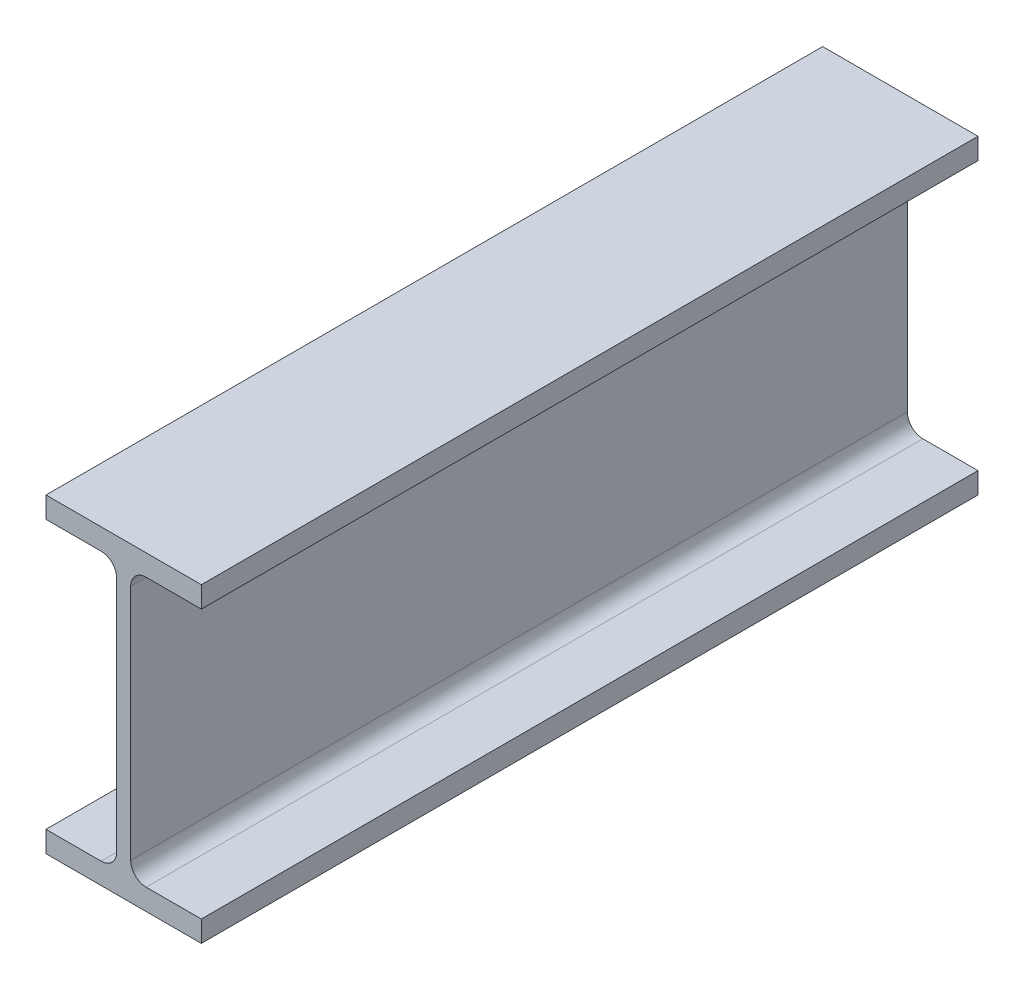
ISO-10303-21;
HEADER;
FILE_DESCRIPTION(('STEP AP214'),'2;1');
FILE_NAME('part.step','',(''),(''),'','','');
FILE_SCHEMA(('AUTOMOTIVE_DESIGN { 1 0 10303 214 1 1 1 1 }'));
ENDSEC;
DATA;
#1=APPLICATION_CONTEXT('core data for automotive mechanical design processes');
#2=APPLICATION_PROTOCOL_DEFINITION('international standard','automotive_design',2000,#1);
#3=PRODUCT_CONTEXT('',#1,'mechanical');
#4=PRODUCT('Part','Part','',(#3));
#5=PRODUCT_RELATED_PRODUCT_CATEGORY('part','',(#4));
#6=PRODUCT_DEFINITION_FORMATION('','',#4);
#7=PRODUCT_DEFINITION_CONTEXT('part definition',#1,'design');
#8=PRODUCT_DEFINITION('design','',#6,#7);
#9=PRODUCT_DEFINITION_SHAPE('','',#8);
#10=(LENGTH_UNIT() NAMED_UNIT(*) SI_UNIT(.MILLI.,.METRE.));
#11=(NAMED_UNIT(*) PLANE_ANGLE_UNIT() SI_UNIT($,.RADIAN.));
#12=(NAMED_UNIT(*) SI_UNIT($,.STERADIAN.) SOLID_ANGLE_UNIT());
#13=UNCERTAINTY_MEASURE_WITH_UNIT(LENGTH_MEASURE(1.E-05),#10,'distance_accuracy_value','');
#14=(GEOMETRIC_REPRESENTATION_CONTEXT(3) GLOBAL_UNCERTAINTY_ASSIGNED_CONTEXT((#13)) GLOBAL_UNIT_ASSIGNED_CONTEXT((#10,
#11,#12)) REPRESENTATION_CONTEXT('',''));
#15=CARTESIAN_POINT('',(0.,0.,0.));
#16=DIRECTION('',(0.,0.,1.));
#17=DIRECTION('',(1.,0.,0.));
#18=AXIS2_PLACEMENT_3D('',#15,#16,#17);
#19=CARTESIAN_POINT('',(-50.,100.,250.));
#20=DIRECTION('',(1.,0.,0.));
#21=DIRECTION('',(0.,0.,-1.));
#22=AXIS2_PLACEMENT_3D('',#19,#20,#21);
#23=PLANE('',#22);
#24=DIRECTION('',(0.,-1.,0.));
#25=VECTOR('',#24,1.);
#26=CARTESIAN_POINT('',(-50.,100.,0.));
#27=LINE('',#26,#25);
#28=CARTESIAN_POINT('',(-50.,100.,0.));
#29=VERTEX_POINT('',#28);
#30=CARTESIAN_POINT('',(-50.,93.2,0.));
#31=VERTEX_POINT('',#30);
#32=EDGE_CURVE('E182',#29,#31,#27,.T.);
#33=ORIENTED_EDGE('',*,*,#32,.T.);
#34=DIRECTION('',(0.,0.,-1.));
#35=VECTOR('',#34,1.);
#36=CARTESIAN_POINT('',(-50.,93.2,250.));
#37=LINE('',#36,#35);
#38=CARTESIAN_POINT('',(-50.,93.2,250.));
#39=VERTEX_POINT('',#38);
#40=EDGE_CURVE('E12',#39,#31,#37,.T.);
#41=ORIENTED_EDGE('',*,*,#40,.F.);
#42=DIRECTION('',(0.,-1.,0.));
#43=VECTOR('',#42,1.);
#44=CARTESIAN_POINT('',(-50.,100.,250.));
#45=LINE('',#44,#43);
#46=CARTESIAN_POINT('',(-50.,100.,250.));
#47=VERTEX_POINT('',#46);
#48=EDGE_CURVE('E212',#47,#39,#45,.T.);
#49=ORIENTED_EDGE('',*,*,#48,.F.);
#50=DIRECTION('',(0.,0.,-1.));
#51=VECTOR('',#50,1.);
#52=CARTESIAN_POINT('',(-50.,100.,250.));
#53=LINE('',#52,#51);
#54=EDGE_CURVE('E178',#47,#29,#53,.T.);
#55=ORIENTED_EDGE('',*,*,#54,.T.);
#56=EDGE_LOOP('',(#33,#41,#49,#55));
#57=FACE_BOUND('',#56,.T.);
#58=ADVANCED_FACE('F38',(#57),#23,.F.);
#59=CARTESIAN_POINT('',(-50.,93.2,250.));
#60=DIRECTION('',(0.,1.,0.));
#61=DIRECTION('',(0.,0.,1.));
#62=AXIS2_PLACEMENT_3D('',#59,#60,#61);
#63=PLANE('',#62);
#64=DIRECTION('',(1.,0.,0.));
#65=VECTOR('',#64,1.);
#66=CARTESIAN_POINT('',(-50.,93.2,0.));
#67=LINE('',#66,#65);
#68=CARTESIAN_POINT('',(-32.25,93.2,0.));
#69=VERTEX_POINT('',#68);
#70=EDGE_CURVE('E185',#31,#69,#67,.T.);
#71=ORIENTED_EDGE('',*,*,#70,.T.);
#72=DIRECTION('',(0.,0.,-1.));
#73=VECTOR('',#72,1.);
#74=CARTESIAN_POINT('',(-32.25,93.2,250.));
#75=LINE('',#74,#73);
#76=CARTESIAN_POINT('',(-32.25,93.2,250.));
#77=VERTEX_POINT('',#76);
#78=EDGE_CURVE('E46',#77,#69,#75,.T.);
#79=ORIENTED_EDGE('',*,*,#78,.F.);
#80=DIRECTION('',(1.,0.,0.));
#81=VECTOR('',#80,1.);
#82=CARTESIAN_POINT('',(-50.,93.2,250.));
#83=LINE('',#82,#81);
#84=EDGE_CURVE('E121',#39,#77,#83,.T.);
#85=ORIENTED_EDGE('',*,*,#84,.F.);
#86=ORIENTED_EDGE('',*,*,#40,.T.);
#87=EDGE_LOOP('',(#71,#79,#85,#86));
#88=FACE_BOUND('',#87,.T.);
#89=ADVANCED_FACE('F310',(#88),#63,.F.);
#90=CARTESIAN_POINT('',(-32.25,88.2,250.));
#91=DIRECTION('',(0.,0.,-1.));
#92=DIRECTION('',(-1.,0.,0.));
#93=AXIS2_PLACEMENT_3D('',#90,#91,#92);
#94=CYLINDRICAL_SURFACE('',#93,5.);
#95=CARTESIAN_POINT('',(-32.25,88.2,0.));
#96=DIRECTION('',(0.,0.,-1.));
#97=DIRECTION('',(1.,0.,0.));
#98=AXIS2_PLACEMENT_3D('',#95,#96,#97);
#99=CIRCLE('',#98,5.);
#100=CARTESIAN_POINT('',(-27.25,88.2,0.));
#101=VERTEX_POINT('',#100);
#102=EDGE_CURVE('E187',#69,#101,#99,.T.);
#103=ORIENTED_EDGE('',*,*,#102,.T.);
#104=DIRECTION('',(0.,0.,-1.));
#105=VECTOR('',#104,1.);
#106=CARTESIAN_POINT('',(-27.25,88.2,250.));
#107=LINE('',#106,#105);
#108=CARTESIAN_POINT('',(-27.25,88.2,250.));
#109=VERTEX_POINT('',#108);
#110=EDGE_CURVE('E243',#109,#101,#107,.T.);
#111=ORIENTED_EDGE('',*,*,#110,.F.);
#112=CARTESIAN_POINT('',(-32.25,88.2,250.));
#113=DIRECTION('',(0.,0.,-1.));
#114=DIRECTION('',(1.,0.,0.));
#115=AXIS2_PLACEMENT_3D('',#112,#113,#114);
#116=CIRCLE('',#115,5.);
#117=EDGE_CURVE('E251',#77,#109,#116,.T.);
#118=ORIENTED_EDGE('',*,*,#117,.F.);
#119=ORIENTED_EDGE('',*,*,#78,.T.);
#120=EDGE_LOOP('',(#103,#111,#118,#119));
#121=FACE_BOUND('',#120,.T.);
#122=ADVANCED_FACE('F249',(#121),#94,.F.);
#123=CARTESIAN_POINT('',(-27.25,88.2,250.));
#124=DIRECTION('',(1.,0.,0.));
#125=DIRECTION('',(0.,1.,0.));
#126=AXIS2_PLACEMENT_3D('',#123,#124,#125);
#127=PLANE('',#126);
#128=DIRECTION('',(0.,-1.,0.));
#129=VECTOR('',#128,1.);
#130=CARTESIAN_POINT('',(-27.25,88.2,0.));
#131=LINE('',#130,#129);
#132=CARTESIAN_POINT('',(-27.25,11.8,0.));
#133=VERTEX_POINT('',#132);
#134=EDGE_CURVE('E189',#101,#133,#131,.T.);
#135=ORIENTED_EDGE('',*,*,#134,.T.);
#136=DIRECTION('',(0.,0.,-1.));
#137=VECTOR('',#136,1.);
#138=CARTESIAN_POINT('',(-27.25,11.8,250.));
#139=LINE('',#138,#137);
#140=CARTESIAN_POINT('',(-27.25,11.8,250.));
#141=VERTEX_POINT('',#140);
#142=EDGE_CURVE('E240',#141,#133,#139,.T.);
#143=ORIENTED_EDGE('',*,*,#142,.F.);
#144=DIRECTION('',(0.,-1.,0.));
#145=VECTOR('',#144,1.);
#146=CARTESIAN_POINT('',(-27.25,88.2,250.));
#147=LINE('',#146,#145);
#148=EDGE_CURVE('E269',#109,#141,#147,.T.);
#149=ORIENTED_EDGE('',*,*,#148,.F.);
#150=ORIENTED_EDGE('',*,*,#110,.T.);
#151=EDGE_LOOP('',(#135,#143,#149,#150));
#152=FACE_BOUND('',#151,.T.);
#153=ADVANCED_FACE('F260',(#152),#127,.F.);
#154=CARTESIAN_POINT('',(-32.25,11.8,250.));
#155=DIRECTION('',(0.,0.,-1.));
#156=DIRECTION('',(-1.,0.,0.));
#157=AXIS2_PLACEMENT_3D('',#154,#155,#156);
#158=CYLINDRICAL_SURFACE('',#157,5.00000000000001);
#159=CARTESIAN_POINT('',(-32.25,11.8,0.));
#160=DIRECTION('',(0.,0.,-1.));
#161=DIRECTION('',(1.,0.,0.));
#162=AXIS2_PLACEMENT_3D('',#159,#160,#161);
#163=CIRCLE('',#162,5.00000000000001);
#164=CARTESIAN_POINT('',(-32.25,6.8,0.));
#165=VERTEX_POINT('',#164);
#166=EDGE_CURVE('E191',#133,#165,#163,.T.);
#167=ORIENTED_EDGE('',*,*,#166,.T.);
#168=DIRECTION('',(0.,0.,-1.));
#169=VECTOR('',#168,1.);
#170=CARTESIAN_POINT('',(-32.25,6.8,250.));
#171=LINE('',#170,#169);
#172=CARTESIAN_POINT('',(-32.25,6.8,250.));
#173=VERTEX_POINT('',#172);
#174=EDGE_CURVE('E237',#173,#165,#171,.T.);
#175=ORIENTED_EDGE('',*,*,#174,.F.);
#176=CARTESIAN_POINT('',(-32.25,11.8,250.));
#177=DIRECTION('',(0.,0.,-1.));
#178=DIRECTION('',(1.,0.,0.));
#179=AXIS2_PLACEMENT_3D('',#176,#177,#178);
#180=CIRCLE('',#179,5.00000000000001);
#181=EDGE_CURVE('E266',#141,#173,#180,.T.);
#182=ORIENTED_EDGE('',*,*,#181,.F.);
#183=ORIENTED_EDGE('',*,*,#142,.T.);
#184=EDGE_LOOP('',(#167,#175,#182,#183));
#185=FACE_BOUND('',#184,.T.);
#186=ADVANCED_FACE('F264',(#185),#158,.F.);
#187=CARTESIAN_POINT('',(-50.,6.8,250.));
#188=DIRECTION('',(0.,-1.,0.));
#189=DIRECTION('',(0.,0.,-1.));
#190=AXIS2_PLACEMENT_3D('',#187,#188,#189);
#191=PLANE('',#190);
#192=DIRECTION('',(-1.,0.,0.));
#193=VECTOR('',#192,1.);
#194=CARTESIAN_POINT('',(-50.,6.8,0.));
#195=LINE('',#194,#193);
#196=CARTESIAN_POINT('',(-50.,6.8,0.));
#197=VERTEX_POINT('',#196);
#198=EDGE_CURVE('E193',#165,#197,#195,.T.);
#199=ORIENTED_EDGE('',*,*,#198,.T.);
#200=DIRECTION('',(0.,0.,-1.));
#201=VECTOR('',#200,1.);
#202=CARTESIAN_POINT('',(-50.,6.8,250.));
#203=LINE('',#202,#201);
#204=CARTESIAN_POINT('',(-50.,6.8,250.));
#205=VERTEX_POINT('',#204);
#206=EDGE_CURVE('E234',#205,#197,#203,.T.);
#207=ORIENTED_EDGE('',*,*,#206,.F.);
#208=DIRECTION('',(-1.,0.,0.));
#209=VECTOR('',#208,1.);
#210=CARTESIAN_POINT('',(-50.,6.8,250.));
#211=LINE('',#210,#209);
#212=EDGE_CURVE('E268',#173,#205,#211,.T.);
#213=ORIENTED_EDGE('',*,*,#212,.F.);
#214=ORIENTED_EDGE('',*,*,#174,.T.);
#215=EDGE_LOOP('',(#199,#207,#213,#214));
#216=FACE_BOUND('',#215,.T.);
#217=ADVANCED_FACE('F323',(#216),#191,.F.);
#218=CARTESIAN_POINT('',(-50.,6.8,250.));
#219=DIRECTION('',(1.,0.,0.));
#220=DIRECTION('',(0.,1.,0.));
#221=AXIS2_PLACEMENT_3D('',#218,#219,#220);
#222=PLANE('',#221);
#223=DIRECTION('',(0.,-1.,0.));
#224=VECTOR('',#223,1.);
#225=CARTESIAN_POINT('',(-50.,6.8,0.));
#226=LINE('',#225,#224);
#227=CARTESIAN_POINT('',(-50.,0.,0.));
#228=VERTEX_POINT('',#227);
#229=EDGE_CURVE('E195',#197,#228,#226,.T.);
#230=ORIENTED_EDGE('',*,*,#229,.T.);
#231=DIRECTION('',(0.,0.,-1.));
#232=VECTOR('',#231,1.);
#233=CARTESIAN_POINT('',(-50.,0.,250.));
#234=LINE('',#233,#232);
#235=CARTESIAN_POINT('',(-50.,0.,250.));
#236=VERTEX_POINT('',#235);
#237=EDGE_CURVE('E231',#236,#228,#234,.T.);
#238=ORIENTED_EDGE('',*,*,#237,.F.);
#239=DIRECTION('',(0.,-1.,0.));
#240=VECTOR('',#239,1.);
#241=CARTESIAN_POINT('',(-50.,6.8,250.));
#242=LINE('',#241,#240);
#243=EDGE_CURVE('E271',#205,#236,#242,.T.);
#244=ORIENTED_EDGE('',*,*,#243,.F.);
#245=ORIENTED_EDGE('',*,*,#206,.T.);
#246=EDGE_LOOP('',(#230,#238,#244,#245));
#247=FACE_BOUND('',#246,.T.);
#248=ADVANCED_FACE('F326',(#247),#222,.F.);
#249=CARTESIAN_POINT('',(-50.,0.,250.));
#250=DIRECTION('',(0.,1.,0.));
#251=DIRECTION('',(0.,0.,1.));
#252=AXIS2_PLACEMENT_3D('',#249,#250,#251);
#253=PLANE('',#252);
#254=DIRECTION('',(1.,0.,0.));
#255=VECTOR('',#254,1.);
#256=CARTESIAN_POINT('',(-50.,0.,0.));
#257=LINE('',#256,#255);
#258=CARTESIAN_POINT('',(0.,0.,0.));
#259=VERTEX_POINT('',#258);
#260=EDGE_CURVE('E197',#228,#259,#257,.T.);
#261=ORIENTED_EDGE('',*,*,#260,.T.);
#262=DIRECTION('',(0.,0.,-1.));
#263=VECTOR('',#262,1.);
#264=CARTESIAN_POINT('',(0.,0.,250.));
#265=LINE('',#264,#263);
#266=CARTESIAN_POINT('',(0.,0.,250.));
#267=VERTEX_POINT('',#266);
#268=EDGE_CURVE('E228',#267,#259,#265,.T.);
#269=ORIENTED_EDGE('',*,*,#268,.F.);
#270=DIRECTION('',(1.,0.,0.));
#271=VECTOR('',#270,1.);
#272=CARTESIAN_POINT('',(-50.,0.,250.));
#273=LINE('',#272,#271);
#274=EDGE_CURVE('E277',#236,#267,#273,.T.);
#275=ORIENTED_EDGE('',*,*,#274,.F.);
#276=ORIENTED_EDGE('',*,*,#237,.T.);
#277=EDGE_LOOP('',(#261,#269,#275,#276));
#278=FACE_BOUND('',#277,.T.);
#279=ADVANCED_FACE('F330',(#278),#253,.F.);
#280=CARTESIAN_POINT('',(0.,6.80000000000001,250.));
#281=DIRECTION('',(-1.,0.,0.));
#282=DIRECTION('',(0.,-1.,0.));
#283=AXIS2_PLACEMENT_3D('',#280,#281,#282);
#284=PLANE('',#283);
#285=DIRECTION('',(0.,1.,0.));
#286=VECTOR('',#285,1.);
#287=CARTESIAN_POINT('',(0.,6.80000000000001,0.));
#288=LINE('',#287,#286);
#289=CARTESIAN_POINT('',(0.,6.80000000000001,0.));
#290=VERTEX_POINT('',#289);
#291=EDGE_CURVE('E199',#259,#290,#288,.T.);
#292=ORIENTED_EDGE('',*,*,#291,.T.);
#293=DIRECTION('',(0.,0.,-1.));
#294=VECTOR('',#293,1.);
#295=CARTESIAN_POINT('',(0.,6.80000000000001,250.));
#296=LINE('',#295,#294);
#297=CARTESIAN_POINT('',(0.,6.80000000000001,250.));
#298=VERTEX_POINT('',#297);
#299=EDGE_CURVE('E225',#298,#290,#296,.T.);
#300=ORIENTED_EDGE('',*,*,#299,.F.);
#301=DIRECTION('',(0.,1.,0.));
#302=VECTOR('',#301,1.);
#303=CARTESIAN_POINT('',(0.,6.80000000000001,250.));
#304=LINE('',#303,#302);
#305=EDGE_CURVE('E279',#267,#298,#304,.T.);
#306=ORIENTED_EDGE('',*,*,#305,.F.);
#307=ORIENTED_EDGE('',*,*,#268,.T.);
#308=EDGE_LOOP('',(#292,#300,#306,#307));
#309=FACE_BOUND('',#308,.T.);
#310=ADVANCED_FACE('F334',(#309),#284,.F.);
#311=CARTESIAN_POINT('',(0.,6.80000000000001,250.));
#312=DIRECTION('',(0.,-1.,0.));
#313=DIRECTION('',(1.,0.,0.));
#314=AXIS2_PLACEMENT_3D('',#311,#312,#313);
#315=PLANE('',#314);
#316=DIRECTION('',(-1.,0.,0.));
#317=VECTOR('',#316,1.);
#318=CARTESIAN_POINT('',(0.,6.80000000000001,0.));
#319=LINE('',#318,#317);
#320=CARTESIAN_POINT('',(-17.75,6.80000000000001,0.));
#321=VERTEX_POINT('',#320);
#322=EDGE_CURVE('E201',#290,#321,#319,.T.);
#323=ORIENTED_EDGE('',*,*,#322,.T.);
#324=DIRECTION('',(0.,0.,-1.));
#325=VECTOR('',#324,1.);
#326=CARTESIAN_POINT('',(-17.75,6.80000000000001,250.));
#327=LINE('',#326,#325);
#328=CARTESIAN_POINT('',(-17.75,6.80000000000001,250.));
#329=VERTEX_POINT('',#328);
#330=EDGE_CURVE('E222',#329,#321,#327,.T.);
#331=ORIENTED_EDGE('',*,*,#330,.F.);
#332=DIRECTION('',(-1.,0.,0.));
#333=VECTOR('',#332,1.);
#334=CARTESIAN_POINT('',(0.,6.80000000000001,250.));
#335=LINE('',#334,#333);
#336=EDGE_CURVE('E281',#298,#329,#335,.T.);
#337=ORIENTED_EDGE('',*,*,#336,.F.);
#338=ORIENTED_EDGE('',*,*,#299,.T.);
#339=EDGE_LOOP('',(#323,#331,#337,#338));
#340=FACE_BOUND('',#339,.T.);
#341=ADVANCED_FACE('F338',(#340),#315,.F.);
#342=CARTESIAN_POINT('',(-17.75,11.8,250.));
#343=DIRECTION('',(0.,0.,-1.));
#344=DIRECTION('',(-1.,0.,0.));
#345=AXIS2_PLACEMENT_3D('',#342,#343,#344);
#346=CYLINDRICAL_SURFACE('',#345,4.99999999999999);
#347=CARTESIAN_POINT('',(-17.75,11.8,0.));
#348=DIRECTION('',(0.,0.,-1.));
#349=DIRECTION('',(1.,0.,0.));
#350=AXIS2_PLACEMENT_3D('',#347,#348,#349);
#351=CIRCLE('',#350,4.99999999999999);
#352=CARTESIAN_POINT('',(-22.75,11.8,0.));
#353=VERTEX_POINT('',#352);
#354=EDGE_CURVE('E203',#321,#353,#351,.T.);
#355=ORIENTED_EDGE('',*,*,#354,.T.);
#356=DIRECTION('',(0.,0.,-1.));
#357=VECTOR('',#356,1.);
#358=CARTESIAN_POINT('',(-22.75,11.8,250.));
#359=LINE('',#358,#357);
#360=CARTESIAN_POINT('',(-22.75,11.8,250.));
#361=VERTEX_POINT('',#360);
#362=EDGE_CURVE('E219',#361,#353,#359,.T.);
#363=ORIENTED_EDGE('',*,*,#362,.F.);
#364=CARTESIAN_POINT('',(-17.75,11.8,250.));
#365=DIRECTION('',(0.,0.,-1.));
#366=DIRECTION('',(1.,0.,0.));
#367=AXIS2_PLACEMENT_3D('',#364,#365,#366);
#368=CIRCLE('',#367,4.99999999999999);
#369=EDGE_CURVE('E283',#329,#361,#368,.T.);
#370=ORIENTED_EDGE('',*,*,#369,.F.);
#371=ORIENTED_EDGE('',*,*,#330,.T.);
#372=EDGE_LOOP('',(#355,#363,#370,#371));
#373=FACE_BOUND('',#372,.T.);
#374=ADVANCED_FACE('F342',(#373),#346,.F.);
#375=CARTESIAN_POINT('',(-22.75,88.2,250.));
#376=DIRECTION('',(-1.,0.,0.));
#377=DIRECTION('',(0.,-1.,0.));
#378=AXIS2_PLACEMENT_3D('',#375,#376,#377);
#379=PLANE('',#378);
#380=DIRECTION('',(0.,1.,0.));
#381=VECTOR('',#380,1.);
#382=CARTESIAN_POINT('',(-22.75,88.2,0.));
#383=LINE('',#382,#381);
#384=CARTESIAN_POINT('',(-22.75,88.2,0.));
#385=VERTEX_POINT('',#384);
#386=EDGE_CURVE('E205',#353,#385,#383,.T.);
#387=ORIENTED_EDGE('',*,*,#386,.T.);
#388=DIRECTION('',(0.,0.,-1.));
#389=VECTOR('',#388,1.);
#390=CARTESIAN_POINT('',(-22.75,88.2,250.));
#391=LINE('',#390,#389);
#392=CARTESIAN_POINT('',(-22.75,88.2,250.));
#393=VERTEX_POINT('',#392);
#394=EDGE_CURVE('E216',#393,#385,#391,.T.);
#395=ORIENTED_EDGE('',*,*,#394,.F.);
#396=DIRECTION('',(0.,1.,0.));
#397=VECTOR('',#396,1.);
#398=CARTESIAN_POINT('',(-22.75,88.2,250.));
#399=LINE('',#398,#397);
#400=EDGE_CURVE('E285',#361,#393,#399,.T.);
#401=ORIENTED_EDGE('',*,*,#400,.F.);
#402=ORIENTED_EDGE('',*,*,#362,.T.);
#403=EDGE_LOOP('',(#387,#395,#401,#402));
#404=FACE_BOUND('',#403,.T.);
#405=ADVANCED_FACE('F291',(#404),#379,.F.);
#406=CARTESIAN_POINT('',(-17.75,88.2,250.));
#407=DIRECTION('',(0.,0.,-1.));
#408=DIRECTION('',(-1.,0.,0.));
#409=AXIS2_PLACEMENT_3D('',#406,#407,#408);
#410=CYLINDRICAL_SURFACE('',#409,5.);
#411=CARTESIAN_POINT('',(-17.75,88.2,0.));
#412=DIRECTION('',(0.,0.,-1.));
#413=DIRECTION('',(1.,0.,0.));
#414=AXIS2_PLACEMENT_3D('',#411,#412,#413);
#415=CIRCLE('',#414,5.);
#416=CARTESIAN_POINT('',(-17.75,93.2,0.));
#417=VERTEX_POINT('',#416);
#418=EDGE_CURVE('E207',#385,#417,#415,.T.);
#419=ORIENTED_EDGE('',*,*,#418,.T.);
#420=DIRECTION('',(0.,0.,-1.));
#421=VECTOR('',#420,1.);
#422=CARTESIAN_POINT('',(-17.75,93.2,250.));
#423=LINE('',#422,#421);
#424=CARTESIAN_POINT('',(-17.75,93.2,250.));
#425=VERTEX_POINT('',#424);
#426=EDGE_CURVE('E173',#425,#417,#423,.T.);
#427=ORIENTED_EDGE('',*,*,#426,.F.);
#428=CARTESIAN_POINT('',(-17.75,88.2,250.));
#429=DIRECTION('',(0.,0.,-1.));
#430=DIRECTION('',(1.,0.,0.));
#431=AXIS2_PLACEMENT_3D('',#428,#429,#430);
#432=CIRCLE('',#431,5.);
#433=EDGE_CURVE('E164',#393,#425,#432,.T.);
#434=ORIENTED_EDGE('',*,*,#433,.F.);
#435=ORIENTED_EDGE('',*,*,#394,.T.);
#436=EDGE_LOOP('',(#419,#427,#434,#435));
#437=FACE_BOUND('',#436,.T.);
#438=ADVANCED_FACE('F295',(#437),#410,.F.);
#439=CARTESIAN_POINT('',(0.,93.2,250.));
#440=DIRECTION('',(0.,1.,0.));
#441=DIRECTION('',(-1.,0.,0.));
#442=AXIS2_PLACEMENT_3D('',#439,#440,#441);
#443=PLANE('',#442);
#444=DIRECTION('',(1.,0.,0.));
#445=VECTOR('',#444,1.);
#446=CARTESIAN_POINT('',(0.,93.2,0.));
#447=LINE('',#446,#445);
#448=CARTESIAN_POINT('',(0.,93.2,0.));
#449=VERTEX_POINT('',#448);
#450=EDGE_CURVE('E172',#417,#449,#447,.T.);
#451=ORIENTED_EDGE('',*,*,#450,.T.);
#452=DIRECTION('',(0.,0.,-1.));
#453=VECTOR('',#452,1.);
#454=CARTESIAN_POINT('',(0.,93.2,250.));
#455=LINE('',#454,#453);
#456=CARTESIAN_POINT('',(0.,93.2,250.));
#457=VERTEX_POINT('',#456);
#458=EDGE_CURVE('E169',#457,#449,#455,.T.);
#459=ORIENTED_EDGE('',*,*,#458,.F.);
#460=DIRECTION('',(1.,0.,0.));
#461=VECTOR('',#460,1.);
#462=CARTESIAN_POINT('',(0.,93.2,250.));
#463=LINE('',#462,#461);
#464=EDGE_CURVE('E158',#425,#457,#463,.T.);
#465=ORIENTED_EDGE('',*,*,#464,.F.);
#466=ORIENTED_EDGE('',*,*,#426,.T.);
#467=EDGE_LOOP('',(#451,#459,#465,#466));
#468=FACE_BOUND('',#467,.T.);
#469=ADVANCED_FACE('F170',(#468),#443,.F.);
#470=CARTESIAN_POINT('',(0.,100.,250.));
#471=DIRECTION('',(-1.,0.,0.));
#472=DIRECTION('',(0.,-1.,0.));
#473=AXIS2_PLACEMENT_3D('',#470,#471,#472);
#474=PLANE('',#473);
#475=DIRECTION('',(0.,1.,0.));
#476=VECTOR('',#475,1.);
#477=CARTESIAN_POINT('',(0.,100.,0.));
#478=LINE('',#477,#476);
#479=CARTESIAN_POINT('',(0.,100.,0.));
#480=VERTEX_POINT('',#479);
#481=EDGE_CURVE('E107',#449,#480,#478,.T.);
#482=ORIENTED_EDGE('',*,*,#481,.T.);
#483=DIRECTION('',(0.,0.,-1.));
#484=VECTOR('',#483,1.);
#485=CARTESIAN_POINT('',(0.,100.,250.));
#486=LINE('',#485,#484);
#487=CARTESIAN_POINT('',(0.,100.,250.));
#488=VERTEX_POINT('',#487);
#489=EDGE_CURVE('E174',#488,#480,#486,.T.);
#490=ORIENTED_EDGE('',*,*,#489,.F.);
#491=DIRECTION('',(0.,1.,0.));
#492=VECTOR('',#491,1.);
#493=CARTESIAN_POINT('',(0.,100.,250.));
#494=LINE('',#493,#492);
#495=EDGE_CURVE('E162',#457,#488,#494,.T.);
#496=ORIENTED_EDGE('',*,*,#495,.F.);
#497=ORIENTED_EDGE('',*,*,#458,.T.);
#498=EDGE_LOOP('',(#482,#490,#496,#497));
#499=FACE_BOUND('',#498,.T.);
#500=ADVANCED_FACE('F176',(#499),#474,.F.);
#501=CARTESIAN_POINT('',(-50.,100.,250.));
#502=DIRECTION('',(0.,-1.,0.));
#503=DIRECTION('',(1.,0.,0.));
#504=AXIS2_PLACEMENT_3D('',#501,#502,#503);
#505=PLANE('',#504);
#506=DIRECTION('',(-1.,0.,0.));
#507=VECTOR('',#506,1.);
#508=CARTESIAN_POINT('',(-50.,100.,0.));
#509=LINE('',#508,#507);
#510=EDGE_CURVE('E113',#480,#29,#509,.T.);
#511=ORIENTED_EDGE('',*,*,#510,.T.);
#512=ORIENTED_EDGE('',*,*,#54,.F.);
#513=DIRECTION('',(-1.,0.,0.));
#514=VECTOR('',#513,1.);
#515=CARTESIAN_POINT('',(-50.,100.,250.));
#516=LINE('',#515,#514);
#517=EDGE_CURVE('E54',#488,#47,#516,.T.);
#518=ORIENTED_EDGE('',*,*,#517,.F.);
#519=ORIENTED_EDGE('',*,*,#489,.T.);
#520=EDGE_LOOP('',(#511,#512,#518,#519));
#521=FACE_BOUND('',#520,.T.);
#522=ADVANCED_FACE('F299',(#521),#505,.F.);
#523=CARTESIAN_POINT('',(-32.25,88.2,250.));
#524=DIRECTION('',(0.,0.,1.));
#525=DIRECTION('',(1.,0.,0.));
#526=AXIS2_PLACEMENT_3D('',#523,#524,#525);
#527=PLANE('',#526);
#528=ORIENTED_EDGE('',*,*,#48,.T.);
#529=ORIENTED_EDGE('',*,*,#84,.T.);
#530=ORIENTED_EDGE('',*,*,#117,.T.);
#531=ORIENTED_EDGE('',*,*,#148,.T.);
#532=ORIENTED_EDGE('',*,*,#181,.T.);
#533=ORIENTED_EDGE('',*,*,#212,.T.);
#534=ORIENTED_EDGE('',*,*,#243,.T.);
#535=ORIENTED_EDGE('',*,*,#274,.T.);
#536=ORIENTED_EDGE('',*,*,#305,.T.);
#537=ORIENTED_EDGE('',*,*,#336,.T.);
#538=ORIENTED_EDGE('',*,*,#369,.T.);
#539=ORIENTED_EDGE('',*,*,#400,.T.);
#540=ORIENTED_EDGE('',*,*,#433,.T.);
#541=ORIENTED_EDGE('',*,*,#464,.T.);
#542=ORIENTED_EDGE('',*,*,#495,.T.);
#543=ORIENTED_EDGE('',*,*,#517,.T.);
#544=EDGE_LOOP('',(#528,#529,#530,#531,#532,#533,#534,#535,#536,#537,#538,#539,#540,#541,#542,#543));
#545=FACE_BOUND('',#544,.T.);
#546=ADVANCED_FACE('F160',(#545),#527,.T.);
#547=CARTESIAN_POINT('',(-32.25,88.2,0.));
#548=DIRECTION('',(0.,0.,1.));
#549=DIRECTION('',(1.,0.,0.));
#550=AXIS2_PLACEMENT_3D('',#547,#548,#549);
#551=PLANE('',#550);
#552=ORIENTED_EDGE('',*,*,#32,.F.);
#553=ORIENTED_EDGE('',*,*,#510,.F.);
#554=ORIENTED_EDGE('',*,*,#481,.F.);
#555=ORIENTED_EDGE('',*,*,#450,.F.);
#556=ORIENTED_EDGE('',*,*,#418,.F.);
#557=ORIENTED_EDGE('',*,*,#386,.F.);
#558=ORIENTED_EDGE('',*,*,#354,.F.);
#559=ORIENTED_EDGE('',*,*,#322,.F.);
#560=ORIENTED_EDGE('',*,*,#291,.F.);
#561=ORIENTED_EDGE('',*,*,#260,.F.);
#562=ORIENTED_EDGE('',*,*,#229,.F.);
#563=ORIENTED_EDGE('',*,*,#198,.F.);
#564=ORIENTED_EDGE('',*,*,#166,.F.);
#565=ORIENTED_EDGE('',*,*,#134,.F.);
#566=ORIENTED_EDGE('',*,*,#102,.F.);
#567=ORIENTED_EDGE('',*,*,#70,.F.);
#568=EDGE_LOOP('',(#552,#553,#554,#555,#556,#557,#558,#559,#560,#561,#562,#563,#564,#565,#566,#567));
#569=FACE_BOUND('',#568,.T.);
#570=ADVANCED_FACE('F255',(#569),#551,.F.);
#571=CLOSED_SHELL('',(#58,#89,#122,#153,#186,#217,#248,#279,#310,#341,#374,#405,#438,#469,#500,
#522,#546,#570));
#572=MANIFOLD_SOLID_BREP('B2',#571);
#573=ADVANCED_BREP_SHAPE_REPRESENTATION('',(#18,#572),#14);
#574=SHAPE_DEFINITION_REPRESENTATION(#9,#573);
ENDSEC;
END-ISO-10303-21;
